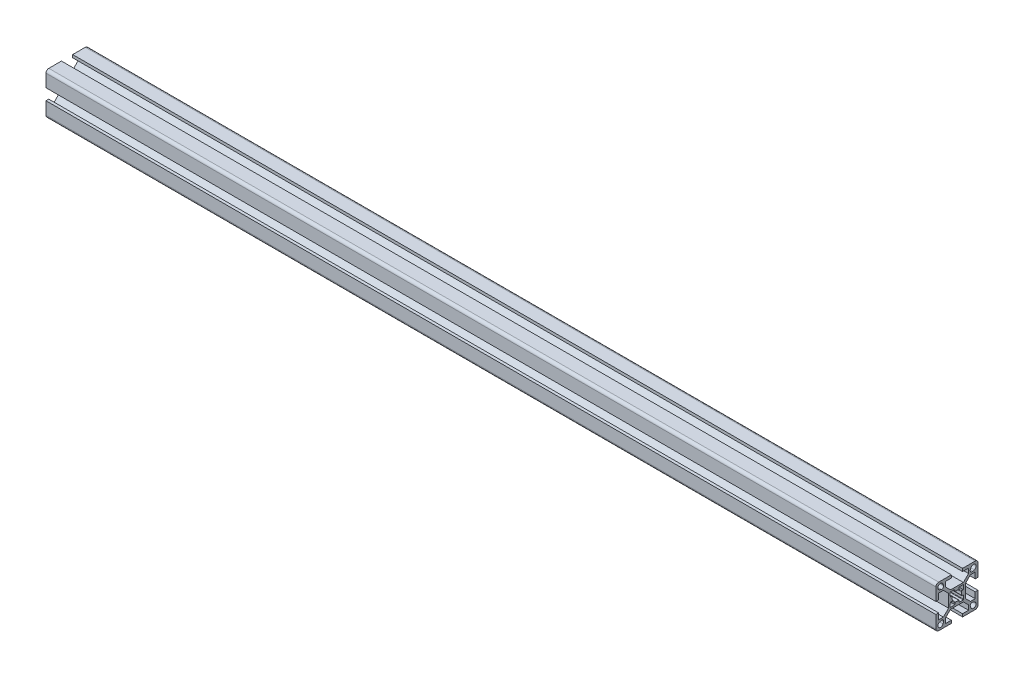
from build123d import *

# Parameters (mm, degrees)
BOSS_EXTRUDE1_DEPTH = 634


with BuildPart() as part:
    # Sketch1 → Boss-Extrude1 (new body)
    with BuildSketch(Plane(origin=(0, 0, 0), x_dir=(0, 0, -1), z_dir=(1, 0, 0))):
        with BuildLine():
            Line((-15, 13), (-15, 4))
            Line((-15, 4), (-13, 4))
            Line((-13, 4), (-13, 8.25))
            Line((-13, 8.25), (-9.664213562, 8.25))
            Line((-9.664213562, 8.25), (-6, 4.585786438))
            Line((-6, 4.585786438), (-6, -4.585786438))
            Line((-6, -4.585786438), (-9.664213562, -8.25))
            Line((-9.664213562, -8.25), (-13, -8.25))
            Line((-13, -8.25), (-13, -4))
            Line((-13, -4), (-15, -4))
            Line((-15, -4), (-15, -13))
            ThreePointArc((-15, -13), (-14.414213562, -14.414213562), (-13, -15))
            Line((-13, -15), (-4, -15))
            Line((-4, -15), (-4, -13))
            Line((-4, -13), (-8.25, -13))
            Line((-8.25, -13), (-8.25, -9.664213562))
            Line((-8.25, -9.664213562), (-4.585786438, -6))
            Line((-4.585786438, -6), (4.585786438, -6))
            Line((4.585786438, -6), (8.25, -9.664213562))
            Line((8.25, -9.664213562), (8.25, -13))
            Line((8.25, -13), (4, -13))
            Line((4, -13), (4, -15))
            Line((4, -15), (13, -15))
            ThreePointArc((13, -15), (14.414213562, -14.414213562), (15, -13))
            Line((15, -13), (15, -4))
            Line((15, -4), (13, -4))
            Line((13, -4), (13, -8.25))
            Line((13, -8.25), (9.664213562, -8.25))
            Line((9.664213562, -8.25), (6, -4.585786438))
            Line((6, -4.585786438), (6, 4.585786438))
            Line((6, 4.585786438), (9.664213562, 8.25))
            Line((9.664213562, 8.25), (13, 8.25))
            Line((13, 8.25), (13, 4))
            Line((13, 4), (15, 4))
            Line((15, 4), (15, 13))
            ThreePointArc((15, 13), (14.414213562, 14.414213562), (13, 15))
            Line((13, 15), (4, 15))
            Line((4, 15), (4, 13))
            Line((4, 13), (8.25, 13))
            Line((8.25, 13), (8.25, 9.664213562))
            Line((8.25, 9.664213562), (4.585786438, 6))
            Line((4.585786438, 6), (-4.585786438, 6))
            Line((-4.585786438, 6), (-8.25, 9.664213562))
            Line((-8.25, 9.664213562), (-8.25, 13))
            Line((-8.25, 13), (-4, 13))
            Line((-4, 13), (-4, 15))
            Line((-4, 15), (-13, 15))
            ThreePointArc((-13, 15), (-14.414213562, 14.414213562), (-15, 13))
        make_face()
        with BuildLine():
            Line((-9.539070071, 11.338915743), (-9.918883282, 12.361530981))
            ThreePointArc((-9.918883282, 12.361530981), (-13.043502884, 13.043502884), (-12.361530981, 9.918883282))
            Line((-12.361530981, 9.918883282), (-11.338915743, 9.539070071))
            ThreePointArc((-11.338915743, 9.539070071), (-9.861522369, 9.861522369), (-9.539070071, 11.338915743))
        make_face(mode=Mode.SUBTRACT)
        with BuildLine():
            Line((9.918883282, 12.361530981), (9.539070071, 11.338915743))
            ThreePointArc((9.539070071, 11.338915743), (9.861522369, 9.861522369), (11.338915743, 9.539070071))
            Line((11.338915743, 9.539070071), (12.361530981, 9.918883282))
            ThreePointArc((12.361530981, 9.918883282), (13.043502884, 13.043502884), (9.918883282, 12.361530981))
        make_face(mode=Mode.SUBTRACT)
        with BuildLine():
            Line((12.361530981, -9.918883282), (11.338915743, -9.539070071))
            ThreePointArc((11.338915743, -9.539070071), (9.861522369, -9.861522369), (9.539070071, -11.338915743))
            Line((9.539070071, -11.338915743), (9.918883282, -12.361530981))
            ThreePointArc((9.918883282, -12.361530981), (13.043502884, -13.043502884), (12.361530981, -9.918883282))
        make_face(mode=Mode.SUBTRACT)
        with BuildLine():
            Line((-11.338915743, -9.539070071), (-12.361530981, -9.918883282))
            ThreePointArc((-12.361530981, -9.918883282), (-13.043502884, -13.043502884), (-9.918883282, -12.361530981))
            Line((-9.918883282, -12.361530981), (-9.539070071, -11.338915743))
            ThreePointArc((-9.539070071, -11.338915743), (-9.861522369, -9.861522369), (-11.338915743, -9.539070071))
        make_face(mode=Mode.SUBTRACT)
        with BuildLine():
            Line((-4.8, -2.644433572), (-4.8, -4.5))
            ThreePointArc((-4.8, -4.5), (-4.712132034, -4.712132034), (-4.5, -4.8))
            Line((-4.5, -4.8), (-2.644433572, -4.8))
            ThreePointArc((-2.644433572, -4.8), (-2.615679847, -4.79861886), (-2.587190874, -4.794488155))
            Line((-2.587190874, -4.794488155), (-1.742757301, -4.630346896))
            ThreePointArc((-1.742757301, -4.630346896), (-1.568512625, -4.526682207), (-1.5, -4.335858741))
            Line((-1.5, -4.335858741), (-1.5, -3.5))
            ThreePointArc((-1.5, -3.5), (-1.374371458, -3.255879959), (-1.102702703, -3.216216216))
            ThreePointArc((-1.102702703, -3.216216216), (0, -3.4), (1.102702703, -3.216216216))
            ThreePointArc((1.102702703, -3.216216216), (1.374371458, -3.255879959), (1.5, -3.5))
            Line((1.5, -3.5), (1.5, -4.335858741))
            ThreePointArc((1.5, -4.335858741), (1.568512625, -4.526682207), (1.742757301, -4.630346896))
            Line((1.742757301, -4.630346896), (2.587190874, -4.794488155))
            ThreePointArc((2.587190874, -4.794488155), (2.615679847, -4.79861886), (2.644433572, -4.8))
            Line((2.644433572, -4.8), (4.5, -4.8))
            ThreePointArc((4.5, -4.8), (4.712132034, -4.712132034), (4.8, -4.5))
            Line((4.8, -4.5), (4.8, -2.644433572))
            ThreePointArc((4.8, -2.644433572), (4.79861886, -2.615679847), (4.794488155, -2.587190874))
            Line((4.794488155, -2.587190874), (4.630346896, -1.742757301))
            ThreePointArc((4.630346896, -1.742757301), (4.526682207, -1.568512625), (4.335858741, -1.5))
            Line((4.335858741, -1.5), (3.5, -1.5))
            ThreePointArc((3.5, -1.5), (3.255879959, -1.374371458), (3.216216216, -1.102702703))
            ThreePointArc((3.216216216, -1.102702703), (3.4, 0), (3.216216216, 1.102702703))
            ThreePointArc((3.216216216, 1.102702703), (3.255879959, 1.374371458), (3.5, 1.5))
            Line((3.5, 1.5), (4.335858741, 1.5))
            ThreePointArc((4.335858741, 1.5), (4.526682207, 1.568512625), (4.630346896, 1.742757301))
            Line((4.630346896, 1.742757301), (4.794488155, 2.587190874))
            ThreePointArc((4.794488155, 2.587190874), (4.79861886, 2.615679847), (4.8, 2.644433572))
            Line((4.8, 2.644433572), (4.8, 4.5))
            ThreePointArc((4.8, 4.5), (4.712132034, 4.712132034), (4.5, 4.8))
            Line((4.5, 4.8), (2.644433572, 4.8))
            ThreePointArc((2.644433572, 4.8), (2.615679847, 4.79861886), (2.587190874, 4.794488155))
            Line((2.587190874, 4.794488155), (1.742757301, 4.630346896))
            ThreePointArc((1.742757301, 4.630346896), (1.568512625, 4.526682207), (1.5, 4.335858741))
            Line((1.5, 4.335858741), (1.5, 3.5))
            ThreePointArc((1.5, 3.5), (1.374371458, 3.255879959), (1.102702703, 3.216216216))
            ThreePointArc((1.102702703, 3.216216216), (0, 3.4), (-1.102702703, 3.216216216))
            ThreePointArc((-1.102702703, 3.216216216), (-1.374371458, 3.255879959), (-1.5, 3.5))
            Line((-1.5, 3.5), (-1.5, 4.335858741))
            ThreePointArc((-1.5, 4.335858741), (-1.568512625, 4.526682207), (-1.742757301, 4.630346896))
            Line((-1.742757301, 4.630346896), (-2.587190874, 4.794488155))
            ThreePointArc((-2.587190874, 4.794488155), (-2.615679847, 4.79861886), (-2.644433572, 4.8))
            Line((-2.644433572, 4.8), (-4.5, 4.8))
            ThreePointArc((-4.5, 4.8), (-4.712132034, 4.712132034), (-4.8, 4.5))
            Line((-4.8, 4.5), (-4.8, 2.644433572))
            ThreePointArc((-4.8, 2.644433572), (-4.79861886, 2.615679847), (-4.794488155, 2.587190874))
            Line((-4.794488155, 2.587190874), (-4.630346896, 1.742757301))
            ThreePointArc((-4.630346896, 1.742757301), (-4.526682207, 1.568512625), (-4.335858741, 1.5))
            Line((-4.335858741, 1.5), (-3.5, 1.5))
            ThreePointArc((-3.5, 1.5), (-3.255879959, 1.374371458), (-3.216216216, 1.102702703))
            ThreePointArc((-3.216216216, 1.102702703), (-3.4, 0), (-3.216216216, -1.102702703))
            ThreePointArc((-3.216216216, -1.102702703), (-3.255879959, -1.374371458), (-3.5, -1.5))
            Line((-3.5, -1.5), (-4.335858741, -1.5))
            ThreePointArc((-4.335858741, -1.5), (-4.526682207, -1.568512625), (-4.630346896, -1.742757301))
            Line((-4.630346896, -1.742757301), (-4.794488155, -2.587190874))
            ThreePointArc((-4.794488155, -2.587190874), (-4.79861886, -2.615679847), (-4.8, -2.644433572))
        make_face(mode=Mode.SUBTRACT)
    extrude(amount=BOSS_EXTRUDE1_DEPTH)


solid = part.part
